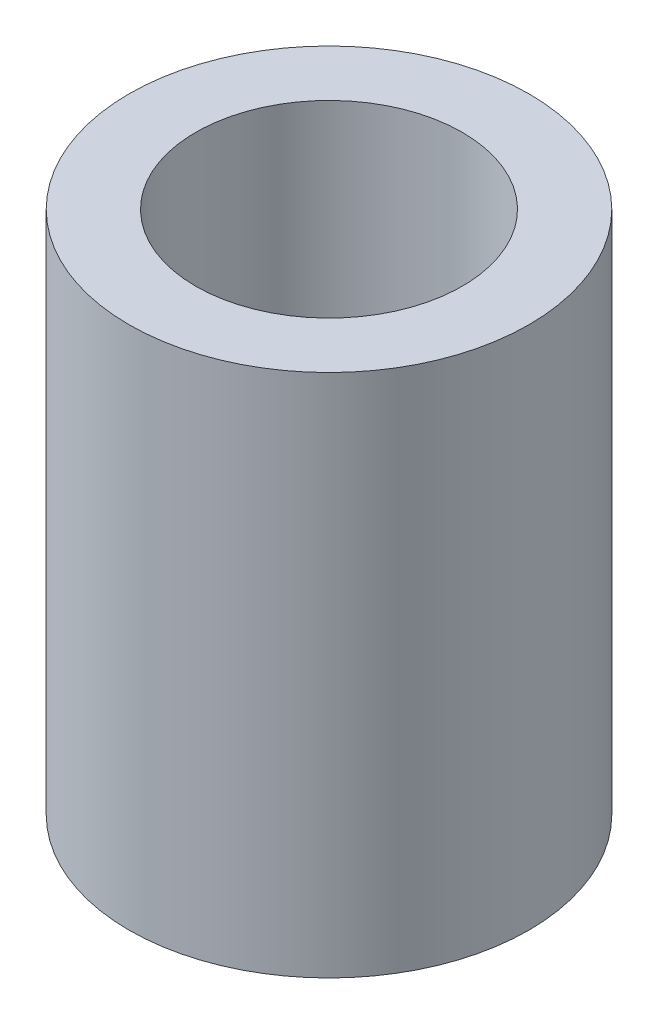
ISO-10303-21;
HEADER;
FILE_DESCRIPTION(('STEP AP214'),'2;1');
FILE_NAME('part.step','',(''),(''),'','','');
FILE_SCHEMA(('AUTOMOTIVE_DESIGN { 1 0 10303 214 1 1 1 1 }'));
ENDSEC;
DATA;
#1=APPLICATION_CONTEXT('core data for automotive mechanical design processes');
#2=APPLICATION_PROTOCOL_DEFINITION('international standard','automotive_design',2000,#1);
#3=PRODUCT_CONTEXT('',#1,'mechanical');
#4=PRODUCT('Part','Part','',(#3));
#5=PRODUCT_RELATED_PRODUCT_CATEGORY('part','',(#4));
#6=PRODUCT_DEFINITION_FORMATION('','',#4);
#7=PRODUCT_DEFINITION_CONTEXT('part definition',#1,'design');
#8=PRODUCT_DEFINITION('design','',#6,#7);
#9=PRODUCT_DEFINITION_SHAPE('','',#8);
#10=(LENGTH_UNIT() NAMED_UNIT(*) SI_UNIT(.MILLI.,.METRE.));
#11=(NAMED_UNIT(*) PLANE_ANGLE_UNIT() SI_UNIT($,.RADIAN.));
#12=(NAMED_UNIT(*) SI_UNIT($,.STERADIAN.) SOLID_ANGLE_UNIT());
#13=UNCERTAINTY_MEASURE_WITH_UNIT(LENGTH_MEASURE(1.E-05),#10,'distance_accuracy_value','');
#14=(GEOMETRIC_REPRESENTATION_CONTEXT(3) GLOBAL_UNCERTAINTY_ASSIGNED_CONTEXT((#13)) GLOBAL_UNIT_ASSIGNED_CONTEXT((#10,
#11,#12)) REPRESENTATION_CONTEXT('',''));
#15=CARTESIAN_POINT('',(0.,0.,0.));
#16=DIRECTION('',(0.,0.,1.));
#17=DIRECTION('',(1.,0.,0.));
#18=AXIS2_PLACEMENT_3D('',#15,#16,#17);
#19=CARTESIAN_POINT('',(0.,59.,0.));
#20=DIRECTION('',(0.,1.,0.));
#21=DIRECTION('',(0.,0.,1.));
#22=AXIS2_PLACEMENT_3D('',#19,#20,#21);
#23=PLANE('',#22);
#24=CARTESIAN_POINT('',(0.,59.,0.));
#25=DIRECTION('',(0.,1.,0.));
#26=DIRECTION('',(0.,0.,1.));
#27=AXIS2_PLACEMENT_3D('',#24,#25,#26);
#28=CIRCLE('',#27,45.);
#29=CARTESIAN_POINT('',(0.,59.,45.));
#30=VERTEX_POINT('',#29);
#31=EDGE_CURVE('E10',#30,#30,#28,.T.);
#32=ORIENTED_EDGE('',*,*,#31,.T.);
#33=EDGE_LOOP('',(#32));
#34=FACE_BOUND('',#33,.T.);
#35=CARTESIAN_POINT('',(0.,59.,0.));
#36=DIRECTION('',(0.,1.,0.));
#37=DIRECTION('',(0.,0.,1.));
#38=AXIS2_PLACEMENT_3D('',#35,#36,#37);
#39=CIRCLE('',#38,30.);
#40=CARTESIAN_POINT('',(0.,59.,30.));
#41=VERTEX_POINT('',#40);
#42=EDGE_CURVE('E38',#41,#41,#39,.T.);
#43=ORIENTED_EDGE('',*,*,#42,.F.);
#44=EDGE_LOOP('',(#43));
#45=FACE_BOUND('',#44,.T.);
#46=ADVANCED_FACE('F31',(#34,#45),#23,.T.);
#47=CARTESIAN_POINT('',(0.,59.,0.));
#48=DIRECTION('',(0.,-1.,0.));
#49=DIRECTION('',(0.,0.,-1.));
#50=AXIS2_PLACEMENT_3D('',#47,#48,#49);
#51=CYLINDRICAL_SURFACE('',#50,45.);
#52=ORIENTED_EDGE('',*,*,#31,.F.);
#53=EDGE_LOOP('',(#52));
#54=FACE_BOUND('',#53,.T.);
#55=CARTESIAN_POINT('',(0.,-59.,0.));
#56=DIRECTION('',(0.,1.,0.));
#57=DIRECTION('',(0.,0.,1.));
#58=AXIS2_PLACEMENT_3D('',#55,#56,#57);
#59=CIRCLE('',#58,45.);
#60=CARTESIAN_POINT('',(0.,-59.,45.));
#61=VERTEX_POINT('',#60);
#62=EDGE_CURVE('E42',#61,#61,#59,.T.);
#63=ORIENTED_EDGE('',*,*,#62,.T.);
#64=EDGE_LOOP('',(#63));
#65=FACE_BOUND('',#64,.T.);
#66=ADVANCED_FACE('F33',(#54,#65),#51,.T.);
#67=CARTESIAN_POINT('',(0.,59.,0.));
#68=DIRECTION('',(0.,-1.,0.));
#69=DIRECTION('',(0.,0.,-1.));
#70=AXIS2_PLACEMENT_3D('',#67,#68,#69);
#71=CYLINDRICAL_SURFACE('',#70,30.);
#72=ORIENTED_EDGE('',*,*,#42,.T.);
#73=EDGE_LOOP('',(#72));
#74=FACE_BOUND('',#73,.T.);
#75=CARTESIAN_POINT('',(0.,-59.,0.));
#76=DIRECTION('',(0.,1.,0.));
#77=DIRECTION('',(0.,0.,1.));
#78=AXIS2_PLACEMENT_3D('',#75,#76,#77);
#79=CIRCLE('',#78,30.);
#80=CARTESIAN_POINT('',(0.,-59.,30.));
#81=VERTEX_POINT('',#80);
#82=EDGE_CURVE('E46',#81,#81,#79,.T.);
#83=ORIENTED_EDGE('',*,*,#82,.F.);
#84=EDGE_LOOP('',(#83));
#85=FACE_BOUND('',#84,.T.);
#86=ADVANCED_FACE('F55',(#74,#85),#71,.F.);
#87=CARTESIAN_POINT('',(0.,-59.,0.));
#88=DIRECTION('',(0.,1.,0.));
#89=DIRECTION('',(0.,0.,1.));
#90=AXIS2_PLACEMENT_3D('',#87,#88,#89);
#91=PLANE('',#90);
#92=ORIENTED_EDGE('',*,*,#82,.T.);
#93=EDGE_LOOP('',(#92));
#94=FACE_BOUND('',#93,.T.);
#95=ORIENTED_EDGE('',*,*,#62,.F.);
#96=EDGE_LOOP('',(#95));
#97=FACE_BOUND('',#96,.T.);
#98=ADVANCED_FACE('F52',(#94,#97),#91,.F.);
#99=CLOSED_SHELL('',(#46,#66,#86,#98));
#100=MANIFOLD_SOLID_BREP('B2',#99);
#101=ADVANCED_BREP_SHAPE_REPRESENTATION('',(#18,#100),#14);
#102=SHAPE_DEFINITION_REPRESENTATION(#9,#101);
ENDSEC;
END-ISO-10303-21;
